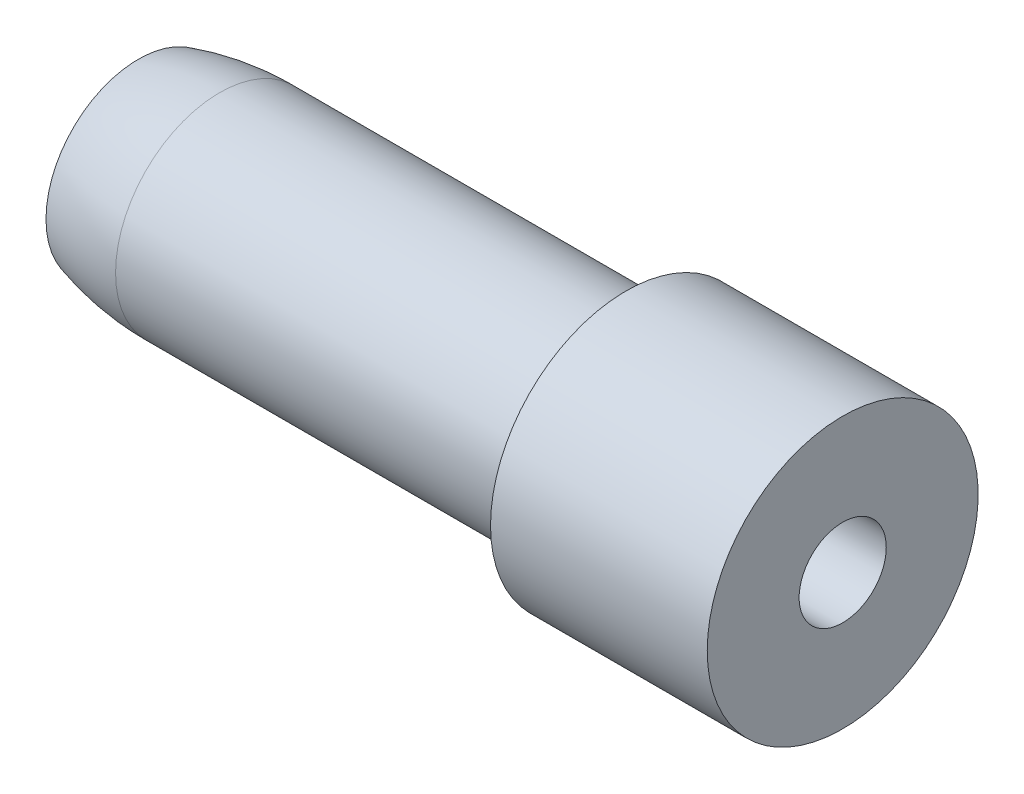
ISO-10303-21;
HEADER;
FILE_DESCRIPTION(('STEP AP214'),'2;1');
FILE_NAME('part.step','',(''),(''),'','','');
FILE_SCHEMA(('AUTOMOTIVE_DESIGN { 1 0 10303 214 1 1 1 1 }'));
ENDSEC;
DATA;
#1=APPLICATION_CONTEXT('core data for automotive mechanical design processes');
#2=APPLICATION_PROTOCOL_DEFINITION('international standard','automotive_design',2000,#1);
#3=PRODUCT_CONTEXT('',#1,'mechanical');
#4=PRODUCT('Part','Part','',(#3));
#5=PRODUCT_RELATED_PRODUCT_CATEGORY('part','',(#4));
#6=PRODUCT_DEFINITION_FORMATION('','',#4);
#7=PRODUCT_DEFINITION_CONTEXT('part definition',#1,'design');
#8=PRODUCT_DEFINITION('design','',#6,#7);
#9=PRODUCT_DEFINITION_SHAPE('','',#8);
#10=(LENGTH_UNIT() NAMED_UNIT(*) SI_UNIT(.MILLI.,.METRE.));
#11=(NAMED_UNIT(*) PLANE_ANGLE_UNIT() SI_UNIT($,.RADIAN.));
#12=(NAMED_UNIT(*) SI_UNIT($,.STERADIAN.) SOLID_ANGLE_UNIT());
#13=UNCERTAINTY_MEASURE_WITH_UNIT(LENGTH_MEASURE(1.E-05),#10,'distance_accuracy_value','');
#14=(GEOMETRIC_REPRESENTATION_CONTEXT(3) GLOBAL_UNCERTAINTY_ASSIGNED_CONTEXT((#13)) GLOBAL_UNIT_ASSIGNED_CONTEXT((#10,
#11,#12)) REPRESENTATION_CONTEXT('',''));
#15=CARTESIAN_POINT('',(0.,0.,0.));
#16=DIRECTION('',(0.,0.,1.));
#17=DIRECTION('',(1.,0.,0.));
#18=AXIS2_PLACEMENT_3D('',#15,#16,#17);
#19=CARTESIAN_POINT('',(-57.15,0.,0.));
#20=DIRECTION('',(-1.,0.,0.));
#21=DIRECTION('',(0.,0.,1.));
#22=AXIS2_PLACEMENT_3D('',#19,#20,#21);
#23=CYLINDRICAL_SURFACE('',#22,7.9375);
#24=CARTESIAN_POINT('',(-28.575,0.,0.));
#25=DIRECTION('',(-1.,0.,0.));
#26=DIRECTION('',(0.,0.,1.));
#27=AXIS2_PLACEMENT_3D('',#24,#25,#26);
#28=CIRCLE('',#27,7.93750000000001);
#29=CARTESIAN_POINT('',(-28.575,0.,7.93750000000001));
#30=VERTEX_POINT('',#29);
#31=EDGE_CURVE('E28',#30,#30,#28,.T.);
#32=ORIENTED_EDGE('',*,*,#31,.F.);
#33=EDGE_LOOP('',(#32));
#34=FACE_BOUND('',#33,.T.);
#35=CARTESIAN_POINT('',(-15.875,0.,0.));
#36=DIRECTION('',(-1.,0.,0.));
#37=DIRECTION('',(0.,0.,1.));
#38=AXIS2_PLACEMENT_3D('',#35,#36,#37);
#39=CIRCLE('',#38,7.9375);
#40=CARTESIAN_POINT('',(-15.875,0.,7.9375));
#41=VERTEX_POINT('',#40);
#42=EDGE_CURVE('E9',#41,#41,#39,.T.);
#43=ORIENTED_EDGE('',*,*,#42,.T.);
#44=EDGE_LOOP('',(#43));
#45=FACE_BOUND('',#44,.T.);
#46=ADVANCED_FACE('F13',(#34,#45),#23,.T.);
#47=CARTESIAN_POINT('',(-52.3875,0.,0.));
#48=DIRECTION('',(-1.,0.,0.));
#49=DIRECTION('',(0.,0.,1.));
#50=AXIS2_PLACEMENT_3D('',#47,#48,#49);
#51=DEGENERATE_TOROIDAL_SURFACE('',#50,10.795,16.891,.F.);
#52=CARTESIAN_POINT('',(-52.3875,0.,0.));
#53=DIRECTION('',(-1.,0.,0.));
#54=DIRECTION('',(0.,0.,1.));
#55=AXIS2_PLACEMENT_3D('',#52,#53,#54);
#56=CIRCLE('',#55,6.096);
#57=CARTESIAN_POINT('',(-52.3875,0.,6.096));
#58=VERTEX_POINT('',#57);
#59=EDGE_CURVE('E20',#58,#58,#56,.T.);
#60=ORIENTED_EDGE('',*,*,#59,.T.);
#61=EDGE_LOOP('',(#60));
#62=FACE_BOUND('',#61,.T.);
#63=CARTESIAN_POINT('',(-57.15,0.,0.));
#64=DIRECTION('',(-1.,0.,0.));
#65=DIRECTION('',(0.,0.,1.));
#66=AXIS2_PLACEMENT_3D('',#63,#64,#65);
#67=CIRCLE('',#66,5.41069266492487);
#68=CARTESIAN_POINT('',(-57.15,0.,5.41069266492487));
#69=VERTEX_POINT('',#68);
#70=EDGE_CURVE('E33',#69,#69,#67,.T.);
#71=ORIENTED_EDGE('',*,*,#70,.F.);
#72=EDGE_LOOP('',(#71));
#73=FACE_BOUND('',#72,.T.);
#74=ADVANCED_FACE('F68',(#62,#73),#51,.F.);
#75=CARTESIAN_POINT('',(-57.15,7.9375,0.));
#76=DIRECTION('',(1.,0.,0.));
#77=DIRECTION('',(0.,0.,-1.));
#78=AXIS2_PLACEMENT_3D('',#75,#76,#77);
#79=PLANE('',#78);
#80=CARTESIAN_POINT('',(-57.15,0.,0.));
#81=DIRECTION('',(1.,0.,0.));
#82=DIRECTION('',(0.,1.,0.));
#83=AXIS2_PLACEMENT_3D('',#80,#81,#82);
#84=CIRCLE('',#83,4.2164);
#85=CARTESIAN_POINT('',(-57.15,4.2164,0.));
#86=VERTEX_POINT('',#85);
#87=EDGE_CURVE('E39',#86,#86,#84,.T.);
#88=ORIENTED_EDGE('',*,*,#87,.T.);
#89=EDGE_LOOP('',(#88));
#90=FACE_BOUND('',#89,.T.);
#91=ORIENTED_EDGE('',*,*,#70,.T.);
#92=EDGE_LOOP('',(#91));
#93=FACE_BOUND('',#92,.T.);
#94=ADVANCED_FACE('F15',(#90,#93),#79,.F.);
#95=CARTESIAN_POINT('',(-25.8125099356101,0.,0.));
#96=DIRECTION('',(1.,0.,0.));
#97=DIRECTION('',(0.,1.,0.));
#98=AXIS2_PLACEMENT_3D('',#95,#96,#97);
#99=CYLINDRICAL_SURFACE('',#98,4.2164);
#100=ORIENTED_EDGE('',*,*,#87,.F.);
#101=EDGE_LOOP('',(#100));
#102=FACE_BOUND('',#101,.T.);
#103=CARTESIAN_POINT('',(-27.559,0.,0.));
#104=DIRECTION('',(1.,0.,0.));
#105=DIRECTION('',(0.,1.,0.));
#106=AXIS2_PLACEMENT_3D('',#103,#104,#105);
#107=CIRCLE('',#106,4.2164);
#108=CARTESIAN_POINT('',(-27.559,4.2164,0.));
#109=VERTEX_POINT('',#108);
#110=EDGE_CURVE('E36',#109,#109,#107,.T.);
#111=ORIENTED_EDGE('',*,*,#110,.T.);
#112=EDGE_LOOP('',(#111));
#113=FACE_BOUND('',#112,.T.);
#114=ADVANCED_FACE('F79',(#102,#113),#99,.F.);
#115=CARTESIAN_POINT('',(-57.15,0.,0.));
#116=DIRECTION('',(-1.,0.,0.));
#117=DIRECTION('',(0.,0.,1.));
#118=AXIS2_PLACEMENT_3D('',#115,#116,#117);
#119=CYLINDRICAL_SURFACE('',#118,6.096);
#120=ORIENTED_EDGE('',*,*,#59,.F.);
#121=EDGE_LOOP('',(#120));
#122=FACE_BOUND('',#121,.T.);
#123=CARTESIAN_POINT('',(-28.575,0.,0.));
#124=DIRECTION('',(-1.,0.,0.));
#125=DIRECTION('',(0.,0.,1.));
#126=AXIS2_PLACEMENT_3D('',#123,#124,#125);
#127=CIRCLE('',#126,6.096);
#128=CARTESIAN_POINT('',(-28.575,0.,6.096));
#129=VERTEX_POINT('',#128);
#130=EDGE_CURVE('E24',#129,#129,#127,.T.);
#131=ORIENTED_EDGE('',*,*,#130,.T.);
#132=EDGE_LOOP('',(#131));
#133=FACE_BOUND('',#132,.T.);
#134=ADVANCED_FACE('F76',(#122,#133),#119,.T.);
#135=CARTESIAN_POINT('',(-28.575,0.,-6.096));
#136=DIRECTION('',(-1.,0.,0.));
#137=DIRECTION('',(0.,0.,1.));
#138=AXIS2_PLACEMENT_3D('',#135,#136,#137);
#139=PLANE('',#138);
#140=ORIENTED_EDGE('',*,*,#31,.T.);
#141=EDGE_LOOP('',(#140));
#142=FACE_BOUND('',#141,.T.);
#143=ORIENTED_EDGE('',*,*,#130,.F.);
#144=EDGE_LOOP('',(#143));
#145=FACE_BOUND('',#144,.T.);
#146=ADVANCED_FACE('F63',(#142,#145),#139,.T.);
#147=CARTESIAN_POINT('',(-25.8125099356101,0.,0.));
#148=DIRECTION('',(-1.,0.,0.));
#149=DIRECTION('',(0.,-1.,0.));
#150=AXIS2_PLACEMENT_3D('',#147,#148,#149);
#151=CONICAL_SURFACE('',#150,0.,1.17809724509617);
#152=CARTESIAN_POINT('',(-26.8698728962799,0.,0.));
#153=DIRECTION('',(-1.,0.,0.));
#154=DIRECTION('',(0.,-1.,0.));
#155=AXIS2_PLACEMENT_3D('',#152,#153,#154);
#156=CIRCLE('',#155,2.55269999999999);
#157=CARTESIAN_POINT('',(-26.8698728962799,-2.55269999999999,0.));
#158=VERTEX_POINT('',#157);
#159=EDGE_CURVE('E42',#158,#158,#156,.F.);
#160=ORIENTED_EDGE('',*,*,#159,.T.);
#161=EDGE_LOOP('',(#160));
#162=FACE_BOUND('',#161,.T.);
#163=ORIENTED_EDGE('',*,*,#110,.F.);
#164=EDGE_LOOP('',(#163));
#165=FACE_BOUND('',#164,.T.);
#166=ADVANCED_FACE('F55',(#162,#165),#151,.F.);
#167=CARTESIAN_POINT('',(-15.875,-127.,-7.93749999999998));
#168=DIRECTION('',(-1.,0.,0.));
#169=DIRECTION('',(0.,0.,1.));
#170=AXIS2_PLACEMENT_3D('',#167,#168,#169);
#171=PLANE('',#170);
#172=CARTESIAN_POINT('',(-15.875,0.,0.));
#173=DIRECTION('',(1.,0.,0.));
#174=DIRECTION('',(0.,0.,-1.));
#175=AXIS2_PLACEMENT_3D('',#172,#173,#174);
#176=CIRCLE('',#175,2.55269999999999);
#177=CARTESIAN_POINT('',(-15.875,0.,-2.55269999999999));
#178=VERTEX_POINT('',#177);
#179=EDGE_CURVE('E45',#178,#178,#176,.T.);
#180=ORIENTED_EDGE('',*,*,#179,.F.);
#181=EDGE_LOOP('',(#180));
#182=FACE_BOUND('',#181,.T.);
#183=ORIENTED_EDGE('',*,*,#42,.F.);
#184=EDGE_LOOP('',(#183));
#185=FACE_BOUND('',#184,.T.);
#186=ADVANCED_FACE('F52',(#182,#185),#171,.F.);
#187=CARTESIAN_POINT('',(-15.875,0.,0.));
#188=DIRECTION('',(1.,0.,0.));
#189=DIRECTION('',(0.,0.,-1.));
#190=AXIS2_PLACEMENT_3D('',#187,#188,#189);
#191=CYLINDRICAL_SURFACE('',#190,2.55269999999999);
#192=ORIENTED_EDGE('',*,*,#179,.T.);
#193=EDGE_LOOP('',(#192));
#194=FACE_BOUND('',#193,.T.);
#195=ORIENTED_EDGE('',*,*,#159,.F.);
#196=EDGE_LOOP('',(#195));
#197=FACE_BOUND('',#196,.T.);
#198=ADVANCED_FACE('F49',(#194,#197),#191,.F.);
#199=CLOSED_SHELL('',(#46,#74,#94,#114,#134,#146,#166,#186,#198));
#200=MANIFOLD_SOLID_BREP('B1',#199);
#201=ADVANCED_BREP_SHAPE_REPRESENTATION('',(#18,#200),#14);
#202=SHAPE_DEFINITION_REPRESENTATION(#9,#201);
ENDSEC;
END-ISO-10303-21;
